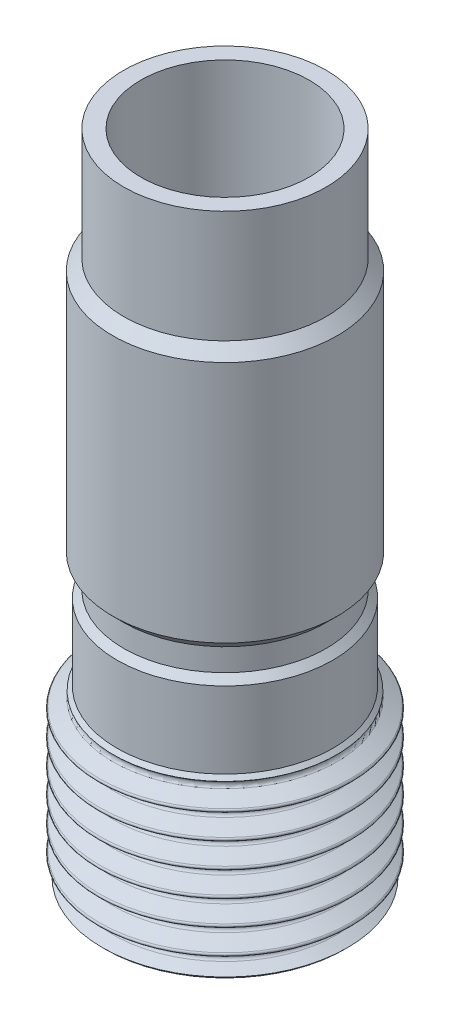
from build123d import *

# Parameters (mm, degrees)
CHAMFER1_SIZE   = 0.381
LPATTERN1_COUNT = 7
LPATTERN1_PITCH = 1.411111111
LPATTERN2_COUNT = 9
LPATTERN2_PITCH = 0.635


with BuildPart() as part:
    # Sketch1 → Revolve1 (revolve)
    with BuildSketch(Plane.XY, mode=Mode.PRIVATE) as revolve1_sk:
        Polygon((-4.7625, 0), (-4.7625, 15.875), (-2.4257, 15.875), (-2.4257, 23.995908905), (-4.7625, 25.4), (-4.7625, 36.83), (-5.7277, 36.83), (-5.7277, 30.48), (-6.35, 29.8577), (-6.35, 16.1163), (-5.7277, 15.494), (-5.7277, 14.224), (-6.1087, 13.843), (-6.1087, 9.525), (-7.14375, 8.48995), (-7.14375, 0), align=None)
    revolve(revolve1_sk.sketch.rotate(Axis((0, 0, 0), (0, 1, 0)), 270), axis=Axis((0, 0, 0), (0, 1, 0)))

    # Chamfer1
    chamfer1_edges = [part.edges().sort_by_distance(p)[0] for p in [
        (0, 0, 4.7625),
        (0, 0, 7.14375),
    ]]
    chamfer(chamfer1_edges, length=CHAMFER1_SIZE)

    # Sketch3 → Outer thread (revolve, cut)
    with BuildSketch(Plane.XY):
        with BuildLine():
            Line((-7.092830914, 8.526638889), (-6.32904462, 8.967611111))
            ThreePointArc((-6.32904462, 8.967611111), (-6.227206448, 9.144), (-6.32904462, 9.320388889))
            Line((-6.32904462, 9.320388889), (-7.092830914, 9.761361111))
            ThreePointArc((-7.092830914, 9.761361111), (-7.130106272, 9.798636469), (-7.14375, 9.849555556))
            Line((-7.14375, 9.849555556), (-7.14375, 8.438444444))
            ThreePointArc((-7.14375, 8.438444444), (-7.130106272, 8.489363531), (-7.092830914, 8.526638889))
        make_face()
    outer_thread = revolve(axis=Axis((0, 0, 0), (0, -1, 0)), mode=Mode.SUBTRACT)

    # LPattern1: Outer thread ×7
    with Locations(*[(0, -i * LPATTERN1_PITCH, 0) for i in range(1, LPATTERN1_COUNT)]):
        add(outer_thread, mode=Mode.SUBTRACT)

    # Sketch4 → Inner thread (revolve, cut)
    with BuildSketch(Plane.XY, mode=Mode.PRIVATE) as inner_thread_sk:
        with BuildLine():
            Line((-5.125827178, 5.18795), (-5.46953101, 5.3863875))
            ThreePointArc((-5.46953101, 5.3863875), (-5.492444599, 5.426075), (-5.46953101, 5.4657625))
            Line((-5.46953101, 5.4657625), (-5.125827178, 5.6642))
            ThreePointArc((-5.125827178, 5.6642), (-5.092279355, 5.697747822), (-5.08, 5.743575))
            Line((-5.08, 5.743575), (-5.08, 6.35))
            Line((-5.08, 6.35), (0, 15.148818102))
            Line((0, 15.148818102), (0, 0))
            Line((0, 0), (-5.08, 0))
            Line((-5.08, 0), (-5.08, 5.108575))
            ThreePointArc((-5.08, 5.108575), (-5.092279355, 5.154402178), (-5.125827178, 5.18795))
        make_face()
    inner_thread = revolve(inner_thread_sk.sketch.rotate(Axis((0, 15.447925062, 0), (0, -1, 0)), 270), axis=Axis((0, 15.447925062, 0), (0, -1, 0)), mode=Mode.SUBTRACT)

    # LPattern2: Inner thread ×9
    with Locations(*[(0, -i * LPATTERN2_PITCH, 0) for i in range(1, LPATTERN2_COUNT)]):
        add(inner_thread, mode=Mode.SUBTRACT)


solid = part.part
